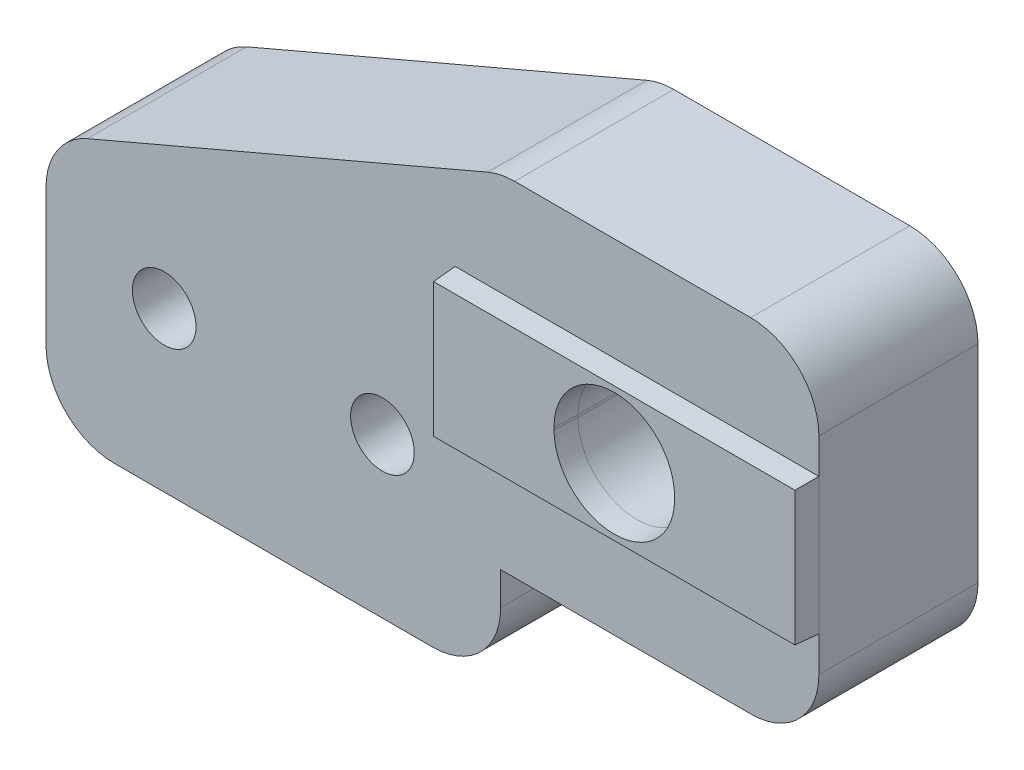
ISO-10303-21;
HEADER;
FILE_DESCRIPTION(('STEP AP214'),'2;1');
FILE_NAME('part.step','',(''),(''),'','','');
FILE_SCHEMA(('AUTOMOTIVE_DESIGN { 1 0 10303 214 1 1 1 1 }'));
ENDSEC;
DATA;
#1=APPLICATION_CONTEXT('core data for automotive mechanical design processes');
#2=APPLICATION_PROTOCOL_DEFINITION('international standard','automotive_design',2000,#1);
#3=PRODUCT_CONTEXT('',#1,'mechanical');
#4=PRODUCT('Part','Part','',(#3));
#5=PRODUCT_RELATED_PRODUCT_CATEGORY('part','',(#4));
#6=PRODUCT_DEFINITION_FORMATION('','',#4);
#7=PRODUCT_DEFINITION_CONTEXT('part definition',#1,'design');
#8=PRODUCT_DEFINITION('design','',#6,#7);
#9=PRODUCT_DEFINITION_SHAPE('','',#8);
#10=(LENGTH_UNIT() NAMED_UNIT(*) SI_UNIT(.MILLI.,.METRE.));
#11=(NAMED_UNIT(*) PLANE_ANGLE_UNIT() SI_UNIT($,.RADIAN.));
#12=(NAMED_UNIT(*) SI_UNIT($,.STERADIAN.) SOLID_ANGLE_UNIT());
#13=UNCERTAINTY_MEASURE_WITH_UNIT(LENGTH_MEASURE(1.E-05),#10,'distance_accuracy_value','');
#14=(GEOMETRIC_REPRESENTATION_CONTEXT(3) GLOBAL_UNCERTAINTY_ASSIGNED_CONTEXT((#13)) GLOBAL_UNIT_ASSIGNED_CONTEXT((#10,
#11,#12)) REPRESENTATION_CONTEXT('',''));
#15=CARTESIAN_POINT('',(0.,0.,0.));
#16=DIRECTION('',(0.,0.,1.));
#17=DIRECTION('',(1.,0.,0.));
#18=AXIS2_PLACEMENT_3D('',#15,#16,#17);
#19=CARTESIAN_POINT('',(31.,7.45,7.));
#20=DIRECTION('',(0.,0.,1.));
#21=DIRECTION('',(1.,0.,0.));
#22=AXIS2_PLACEMENT_3D('',#19,#20,#21);
#23=PLANE('',#22);
#24=CARTESIAN_POINT('',(14.8,7.,7.));
#25=DIRECTION('',(0.,0.,1.));
#26=DIRECTION('',(1.,0.,0.));
#27=AXIS2_PLACEMENT_3D('',#24,#25,#26);
#28=CIRCLE('',#27,1.4);
#29=CARTESIAN_POINT('',(16.2,7.,7.));
#30=VERTEX_POINT('',#29);
#31=EDGE_CURVE('E464',#30,#30,#28,.T.);
#32=ORIENTED_EDGE('',*,*,#31,.F.);
#33=EDGE_LOOP('',(#32));
#34=FACE_BOUND('',#33,.T.);
#35=CARTESIAN_POINT('',(5.2,7.,7.));
#36=DIRECTION('',(0.,0.,1.));
#37=DIRECTION('',(1.,0.,0.));
#38=AXIS2_PLACEMENT_3D('',#35,#36,#37);
#39=CIRCLE('',#38,1.4);
#40=CARTESIAN_POINT('',(6.6,7.,7.));
#41=VERTEX_POINT('',#40);
#42=EDGE_CURVE('E470',#41,#41,#39,.T.);
#43=ORIENTED_EDGE('',*,*,#42,.F.);
#44=EDGE_LOOP('',(#43));
#45=FACE_BOUND('',#44,.T.);
#46=DIRECTION('',(0.,-1.,0.));
#47=VECTOR('',#46,1.);
#48=CARTESIAN_POINT('',(18.,0.,7.));
#49=LINE('',#48,#47);
#50=CARTESIAN_POINT('',(18.,15.,7.));
#51=VERTEX_POINT('',#50);
#52=CARTESIAN_POINT('',(18.,9.,7.));
#53=VERTEX_POINT('',#52);
#54=EDGE_CURVE('E52',#51,#53,#49,.T.);
#55=ORIENTED_EDGE('',*,*,#54,.F.);
#56=DIRECTION('',(1.,0.,0.));
#57=VECTOR('',#56,1.);
#58=CARTESIAN_POINT('',(0.,15.,7.));
#59=LINE('',#58,#57);
#60=CARTESIAN_POINT('',(34.,15.,7.));
#61=VERTEX_POINT('',#60);
#62=EDGE_CURVE('E57',#51,#61,#59,.T.);
#63=ORIENTED_EDGE('',*,*,#62,.T.);
#64=DIRECTION('',(0.,1.,0.));
#65=VECTOR('',#64,1.);
#66=CARTESIAN_POINT('',(34.,7.45,7.));
#67=LINE('',#66,#65);
#68=CARTESIAN_POINT('',(34.,16.55,7.));
#69=VERTEX_POINT('',#68);
#70=EDGE_CURVE('E263',#61,#69,#67,.T.);
#71=ORIENTED_EDGE('',*,*,#70,.T.);
#72=CARTESIAN_POINT('',(31.,16.55,7.));
#73=DIRECTION('',(0.,0.,1.));
#74=DIRECTION('',(1.,0.,0.));
#75=AXIS2_PLACEMENT_3D('',#72,#73,#74);
#76=CIRCLE('',#75,3.);
#77=CARTESIAN_POINT('',(31.,19.55,7.));
#78=VERTEX_POINT('',#77);
#79=EDGE_CURVE('E268',#69,#78,#76,.T.);
#80=ORIENTED_EDGE('',*,*,#79,.T.);
#81=DIRECTION('',(-1.,0.,0.));
#82=VECTOR('',#81,1.);
#83=CARTESIAN_POINT('',(20.6143577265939,19.55,7.));
#84=LINE('',#83,#82);
#85=CARTESIAN_POINT('',(20.6143577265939,19.55,7.));
#86=VERTEX_POINT('',#85);
#87=EDGE_CURVE('E270',#78,#86,#84,.T.);
#88=ORIENTED_EDGE('',*,*,#87,.T.);
#89=CARTESIAN_POINT('',(20.6143577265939,16.55,7.));
#90=DIRECTION('',(0.,0.,1.));
#91=DIRECTION('',(1.,0.,0.));
#92=AXIS2_PLACEMENT_3D('',#89,#90,#91);
#93=CIRCLE('',#92,3.);
#94=CARTESIAN_POINT('',(19.4350972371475,19.3085040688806,7.));
#95=VERTEX_POINT('',#94);
#96=EDGE_CURVE('E272',#86,#95,#93,.T.);
#97=ORIENTED_EDGE('',*,*,#96,.T.);
#98=DIRECTION('',(-0.919501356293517,-0.393086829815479,0.));
#99=VECTOR('',#98,1.);
#100=CARTESIAN_POINT('',(19.4350972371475,19.3085040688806,7.));
#101=LINE('',#100,#99);
#102=CARTESIAN_POINT('',(1.82073951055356,11.7783661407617,7.));
#103=VERTEX_POINT('',#102);
#104=EDGE_CURVE('E274',#95,#103,#101,.T.);
#105=ORIENTED_EDGE('',*,*,#104,.T.);
#106=CARTESIAN_POINT('',(3.,9.0198620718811,7.));
#107=DIRECTION('',(0.,0.,1.));
#108=DIRECTION('',(1.,0.,0.));
#109=AXIS2_PLACEMENT_3D('',#106,#107,#108);
#110=CIRCLE('',#109,3.);
#111=CARTESIAN_POINT('',(0.,9.0198620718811,7.));
#112=VERTEX_POINT('',#111);
#113=EDGE_CURVE('E276',#103,#112,#110,.T.);
#114=ORIENTED_EDGE('',*,*,#113,.T.);
#115=DIRECTION('',(0.,-1.,0.));
#116=VECTOR('',#115,1.);
#117=CARTESIAN_POINT('',(0.,9.0198620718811,7.));
#118=LINE('',#117,#116);
#119=CARTESIAN_POINT('',(0.,3.00000000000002,7.));
#120=VERTEX_POINT('',#119);
#121=EDGE_CURVE('E278',#112,#120,#118,.T.);
#122=ORIENTED_EDGE('',*,*,#121,.T.);
#123=CARTESIAN_POINT('',(3.,3.,7.));
#124=DIRECTION('',(0.,0.,1.));
#125=DIRECTION('',(1.,0.,0.));
#126=AXIS2_PLACEMENT_3D('',#123,#124,#125);
#127=CIRCLE('',#126,3.);
#128=CARTESIAN_POINT('',(3.00000000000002,0.,7.));
#129=VERTEX_POINT('',#128);
#130=EDGE_CURVE('E280',#120,#129,#127,.T.);
#131=ORIENTED_EDGE('',*,*,#130,.T.);
#132=DIRECTION('',(1.,0.,0.));
#133=VECTOR('',#132,1.);
#134=CARTESIAN_POINT('',(3.00000000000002,0.,7.));
#135=LINE('',#134,#133);
#136=CARTESIAN_POINT('',(17.,0.,7.));
#137=VERTEX_POINT('',#136);
#138=EDGE_CURVE('E282',#129,#137,#135,.T.);
#139=ORIENTED_EDGE('',*,*,#138,.T.);
#140=CARTESIAN_POINT('',(17.,3.,7.));
#141=DIRECTION('',(0.,0.,1.));
#142=DIRECTION('',(1.,0.,0.));
#143=AXIS2_PLACEMENT_3D('',#140,#141,#142);
#144=CIRCLE('',#143,3.);
#145=CARTESIAN_POINT('',(20.,3.00000000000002,7.));
#146=VERTEX_POINT('',#145);
#147=EDGE_CURVE('E284',#137,#146,#144,.T.);
#148=ORIENTED_EDGE('',*,*,#147,.T.);
#149=DIRECTION('',(0.,1.,0.));
#150=VECTOR('',#149,1.);
#151=CARTESIAN_POINT('',(20.,3.00000000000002,7.));
#152=LINE('',#151,#150);
#153=CARTESIAN_POINT('',(20.,4.45,7.));
#154=VERTEX_POINT('',#153);
#155=EDGE_CURVE('E286',#146,#154,#152,.T.);
#156=ORIENTED_EDGE('',*,*,#155,.T.);
#157=DIRECTION('',(1.,0.,0.));
#158=VECTOR('',#157,1.);
#159=CARTESIAN_POINT('',(20.,4.45,7.));
#160=LINE('',#159,#158);
#161=CARTESIAN_POINT('',(31.,4.45,7.));
#162=VERTEX_POINT('',#161);
#163=EDGE_CURVE('E288',#154,#162,#160,.T.);
#164=ORIENTED_EDGE('',*,*,#163,.T.);
#165=CARTESIAN_POINT('',(31.,7.45,7.));
#166=DIRECTION('',(0.,0.,1.));
#167=DIRECTION('',(1.,0.,0.));
#168=AXIS2_PLACEMENT_3D('',#165,#166,#167);
#169=CIRCLE('',#168,3.);
#170=CARTESIAN_POINT('',(34.,7.45,7.));
#171=VERTEX_POINT('',#170);
#172=EDGE_CURVE('E260',#162,#171,#169,.T.);
#173=ORIENTED_EDGE('',*,*,#172,.T.);
#174=CARTESIAN_POINT('',(34.,9.,7.));
#175=VERTEX_POINT('',#174);
#176=EDGE_CURVE('E265',#171,#175,#67,.T.);
#177=ORIENTED_EDGE('',*,*,#176,.T.);
#178=DIRECTION('',(1.,0.,0.));
#179=VECTOR('',#178,1.);
#180=CARTESIAN_POINT('',(0.,9.,7.));
#181=LINE('',#180,#179);
#182=EDGE_CURVE('E394',#53,#175,#181,.T.);
#183=ORIENTED_EDGE('',*,*,#182,.F.);
#184=EDGE_LOOP('',(#55,#63,#71,#80,#88,#97,#105,#114,#122,#131,#139,#148,#156,#164,#173,#177,#183));
#185=FACE_BOUND('',#184,.T.);
#186=ADVANCED_FACE('F37',(#34,#45,#185),#23,.T.);
#187=CARTESIAN_POINT('',(26.,12.05,7.));
#188=DIRECTION('',(0.,0.,-1.));
#189=DIRECTION('',(-1.,0.,0.));
#190=AXIS2_PLACEMENT_3D('',#187,#188,#189);
#191=CYLINDRICAL_SURFACE('',#190,2.6);
#192=DIRECTION('',(0.,0.,-1.));
#193=VECTOR('',#192,1.);
#194=CARTESIAN_POINT('',(23.4,12.05,7.));
#195=LINE('',#194,#193);
#196=CARTESIAN_POINT('',(23.4,12.05,7.));
#197=VERTEX_POINT('',#196);
#198=CARTESIAN_POINT('',(23.4,12.05,2.5));
#199=VERTEX_POINT('',#198);
#200=EDGE_CURVE('E246',#197,#199,#195,.T.);
#201=ORIENTED_EDGE('',*,*,#200,.T.);
#202=CARTESIAN_POINT('',(26.,12.05,2.5));
#203=DIRECTION('',(0.,0.,-1.));
#204=DIRECTION('',(-1.,0.,0.));
#205=AXIS2_PLACEMENT_3D('',#202,#203,#204);
#206=CIRCLE('',#205,2.6);
#207=CARTESIAN_POINT('',(28.6,12.05,2.5));
#208=VERTEX_POINT('',#207);
#209=EDGE_CURVE('E460',#199,#208,#206,.T.);
#210=ORIENTED_EDGE('',*,*,#209,.T.);
#211=DIRECTION('',(0.,0.,-1.));
#212=VECTOR('',#211,1.);
#213=CARTESIAN_POINT('',(28.6,12.05,7.));
#214=LINE('',#213,#212);
#215=CARTESIAN_POINT('',(28.6,12.05,7.));
#216=VERTEX_POINT('',#215);
#217=EDGE_CURVE('E256',#216,#208,#214,.T.);
#218=ORIENTED_EDGE('',*,*,#217,.F.);
#219=CARTESIAN_POINT('',(26.,12.05,7.));
#220=DIRECTION('',(0.,0.,1.));
#221=DIRECTION('',(1.,0.,0.));
#222=AXIS2_PLACEMENT_3D('',#219,#220,#221);
#223=CIRCLE('',#222,2.6);
#224=EDGE_CURVE('E247',#216,#197,#223,.T.);
#225=ORIENTED_EDGE('',*,*,#224,.T.);
#226=EDGE_LOOP('',(#201,#210,#218,#225));
#227=FACE_BOUND('',#226,.T.);
#228=ADVANCED_FACE('F484',(#227),#191,.F.);
#229=CARTESIAN_POINT('',(23.4,12.05,7.));
#230=DIRECTION('',(1.,0.,0.));
#231=DIRECTION('',(0.,0.,-1.));
#232=AXIS2_PLACEMENT_3D('',#229,#230,#231);
#233=PLANE('',#232);
#234=DIRECTION('',(0.,0.,-1.));
#235=VECTOR('',#234,1.);
#236=CARTESIAN_POINT('',(23.4,11.95,7.));
#237=LINE('',#236,#235);
#238=CARTESIAN_POINT('',(23.4,11.95,7.));
#239=VERTEX_POINT('',#238);
#240=CARTESIAN_POINT('',(23.4,11.95,2.5));
#241=VERTEX_POINT('',#240);
#242=EDGE_CURVE('E244',#239,#241,#237,.T.);
#243=ORIENTED_EDGE('',*,*,#242,.T.);
#244=DIRECTION('',(0.,1.,0.));
#245=VECTOR('',#244,1.);
#246=CARTESIAN_POINT('',(23.4,12.05,2.5));
#247=LINE('',#246,#245);
#248=EDGE_CURVE('E458',#241,#199,#247,.T.);
#249=ORIENTED_EDGE('',*,*,#248,.T.);
#250=ORIENTED_EDGE('',*,*,#200,.F.);
#251=DIRECTION('',(0.,-1.,0.));
#252=VECTOR('',#251,1.);
#253=CARTESIAN_POINT('',(23.4,12.05,7.));
#254=LINE('',#253,#252);
#255=EDGE_CURVE('E219',#197,#239,#254,.T.);
#256=ORIENTED_EDGE('',*,*,#255,.T.);
#257=EDGE_LOOP('',(#243,#249,#250,#256));
#258=FACE_BOUND('',#257,.T.);
#259=ADVANCED_FACE('F242',(#258),#233,.T.);
#260=CARTESIAN_POINT('',(26.,11.95,7.));
#261=DIRECTION('',(0.,0.,-1.));
#262=DIRECTION('',(-1.,0.,0.));
#263=AXIS2_PLACEMENT_3D('',#260,#261,#262);
#264=CYLINDRICAL_SURFACE('',#263,2.6);
#265=DIRECTION('',(0.,0.,-1.));
#266=VECTOR('',#265,1.);
#267=CARTESIAN_POINT('',(28.6,11.95,7.));
#268=LINE('',#267,#266);
#269=CARTESIAN_POINT('',(28.6,11.95,7.));
#270=VERTEX_POINT('',#269);
#271=CARTESIAN_POINT('',(28.6,11.95,2.5));
#272=VERTEX_POINT('',#271);
#273=EDGE_CURVE('E252',#270,#272,#268,.T.);
#274=ORIENTED_EDGE('',*,*,#273,.T.);
#275=CARTESIAN_POINT('',(26.,11.95,2.5));
#276=DIRECTION('',(0.,0.,-1.));
#277=DIRECTION('',(-1.,0.,0.));
#278=AXIS2_PLACEMENT_3D('',#275,#276,#277);
#279=CIRCLE('',#278,2.6);
#280=EDGE_CURVE('E251',#272,#241,#279,.T.);
#281=ORIENTED_EDGE('',*,*,#280,.T.);
#282=ORIENTED_EDGE('',*,*,#242,.F.);
#283=CARTESIAN_POINT('',(26.,11.95,7.));
#284=DIRECTION('',(0.,0.,1.));
#285=DIRECTION('',(1.,0.,0.));
#286=AXIS2_PLACEMENT_3D('',#283,#284,#285);
#287=CIRCLE('',#286,2.6);
#288=EDGE_CURVE('E229',#239,#270,#287,.T.);
#289=ORIENTED_EDGE('',*,*,#288,.T.);
#290=EDGE_LOOP('',(#274,#281,#282,#289));
#291=FACE_BOUND('',#290,.T.);
#292=ADVANCED_FACE('F250',(#291),#264,.F.);
#293=CARTESIAN_POINT('',(28.6,12.05,7.));
#294=DIRECTION('',(-1.,0.,0.));
#295=DIRECTION('',(0.,0.,1.));
#296=AXIS2_PLACEMENT_3D('',#293,#294,#295);
#297=PLANE('',#296);
#298=ORIENTED_EDGE('',*,*,#217,.T.);
#299=DIRECTION('',(0.,-1.,0.));
#300=VECTOR('',#299,1.);
#301=CARTESIAN_POINT('',(28.6,12.05,2.5));
#302=LINE('',#301,#300);
#303=EDGE_CURVE('E11',#208,#272,#302,.T.);
#304=ORIENTED_EDGE('',*,*,#303,.T.);
#305=ORIENTED_EDGE('',*,*,#273,.F.);
#306=DIRECTION('',(0.,1.,0.));
#307=VECTOR('',#306,1.);
#308=CARTESIAN_POINT('',(28.6,12.05,7.));
#309=LINE('',#308,#307);
#310=EDGE_CURVE('E237',#270,#216,#309,.T.);
#311=ORIENTED_EDGE('',*,*,#310,.T.);
#312=EDGE_LOOP('',(#298,#304,#305,#311));
#313=FACE_BOUND('',#312,.T.);
#314=ADVANCED_FACE('F481',(#313),#297,.T.);
#315=CARTESIAN_POINT('',(31.,7.45,0.));
#316=DIRECTION('',(0.,0.,1.));
#317=DIRECTION('',(1.,0.,0.));
#318=AXIS2_PLACEMENT_3D('',#315,#316,#317);
#319=PLANE('',#318);
#320=DIRECTION('',(0.,-1.,0.));
#321=VECTOR('',#320,1.);
#322=CARTESIAN_POINT('',(30.75,12.05,0.));
#323=LINE('',#322,#321);
#324=CARTESIAN_POINT('',(30.75,12.05,0.));
#325=VERTEX_POINT('',#324);
#326=CARTESIAN_POINT('',(30.75,11.95,0.));
#327=VERTEX_POINT('',#326);
#328=EDGE_CURVE('E441',#325,#327,#323,.T.);
#329=ORIENTED_EDGE('',*,*,#328,.F.);
#330=CARTESIAN_POINT('',(26.,12.05,0.));
#331=DIRECTION('',(0.,0.,-1.));
#332=DIRECTION('',(-1.,0.,0.));
#333=AXIS2_PLACEMENT_3D('',#330,#331,#332);
#334=CIRCLE('',#333,4.75);
#335=CARTESIAN_POINT('',(21.25,12.05,0.));
#336=VERTEX_POINT('',#335);
#337=EDGE_CURVE('E412',#336,#325,#334,.T.);
#338=ORIENTED_EDGE('',*,*,#337,.F.);
#339=DIRECTION('',(0.,1.,0.));
#340=VECTOR('',#339,1.);
#341=CARTESIAN_POINT('',(21.25,12.05,0.));
#342=LINE('',#341,#340);
#343=CARTESIAN_POINT('',(21.25,11.95,0.));
#344=VERTEX_POINT('',#343);
#345=EDGE_CURVE('E430',#344,#336,#342,.T.);
#346=ORIENTED_EDGE('',*,*,#345,.F.);
#347=CARTESIAN_POINT('',(26.,11.95,0.));
#348=DIRECTION('',(0.,0.,-1.));
#349=DIRECTION('',(-1.,0.,0.));
#350=AXIS2_PLACEMENT_3D('',#347,#348,#349);
#351=CIRCLE('',#350,4.75);
#352=EDGE_CURVE('E444',#327,#344,#351,.T.);
#353=ORIENTED_EDGE('',*,*,#352,.F.);
#354=EDGE_LOOP('',(#329,#338,#346,#353));
#355=FACE_BOUND('',#354,.T.);
#356=CARTESIAN_POINT('',(31.,7.45,0.));
#357=DIRECTION('',(0.,0.,1.));
#358=DIRECTION('',(1.,0.,0.));
#359=AXIS2_PLACEMENT_3D('',#356,#357,#358);
#360=CIRCLE('',#359,3.);
#361=CARTESIAN_POINT('',(31.,4.45,0.));
#362=VERTEX_POINT('',#361);
#363=CARTESIAN_POINT('',(34.,7.45,0.));
#364=VERTEX_POINT('',#363);
#365=EDGE_CURVE('E254',#362,#364,#360,.T.);
#366=ORIENTED_EDGE('',*,*,#365,.F.);
#367=DIRECTION('',(1.,0.,0.));
#368=VECTOR('',#367,1.);
#369=CARTESIAN_POINT('',(20.,4.45,0.));
#370=LINE('',#369,#368);
#371=CARTESIAN_POINT('',(20.,4.45,0.));
#372=VERTEX_POINT('',#371);
#373=EDGE_CURVE('E264',#372,#362,#370,.T.);
#374=ORIENTED_EDGE('',*,*,#373,.F.);
#375=DIRECTION('',(0.,1.,0.));
#376=VECTOR('',#375,1.);
#377=CARTESIAN_POINT('',(20.,3.00000000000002,0.));
#378=LINE('',#377,#376);
#379=CARTESIAN_POINT('',(20.,3.00000000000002,0.));
#380=VERTEX_POINT('',#379);
#381=EDGE_CURVE('E313',#380,#372,#378,.T.);
#382=ORIENTED_EDGE('',*,*,#381,.F.);
#383=CARTESIAN_POINT('',(17.,3.,0.));
#384=DIRECTION('',(0.,0.,1.));
#385=DIRECTION('',(1.,0.,0.));
#386=AXIS2_PLACEMENT_3D('',#383,#384,#385);
#387=CIRCLE('',#386,3.);
#388=CARTESIAN_POINT('',(17.,0.,0.));
#389=VERTEX_POINT('',#388);
#390=EDGE_CURVE('E311',#389,#380,#387,.T.);
#391=ORIENTED_EDGE('',*,*,#390,.F.);
#392=DIRECTION('',(1.,0.,0.));
#393=VECTOR('',#392,1.);
#394=CARTESIAN_POINT('',(3.00000000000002,0.,0.));
#395=LINE('',#394,#393);
#396=CARTESIAN_POINT('',(3.00000000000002,0.,0.));
#397=VERTEX_POINT('',#396);
#398=EDGE_CURVE('E309',#397,#389,#395,.T.);
#399=ORIENTED_EDGE('',*,*,#398,.F.);
#400=CARTESIAN_POINT('',(3.,3.,0.));
#401=DIRECTION('',(0.,0.,1.));
#402=DIRECTION('',(1.,0.,0.));
#403=AXIS2_PLACEMENT_3D('',#400,#401,#402);
#404=CIRCLE('',#403,3.);
#405=CARTESIAN_POINT('',(0.,3.00000000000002,0.));
#406=VERTEX_POINT('',#405);
#407=EDGE_CURVE('E307',#406,#397,#404,.T.);
#408=ORIENTED_EDGE('',*,*,#407,.F.);
#409=DIRECTION('',(0.,-1.,0.));
#410=VECTOR('',#409,1.);
#411=CARTESIAN_POINT('',(0.,9.0198620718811,0.));
#412=LINE('',#411,#410);
#413=CARTESIAN_POINT('',(0.,9.0198620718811,0.));
#414=VERTEX_POINT('',#413);
#415=EDGE_CURVE('E305',#414,#406,#412,.T.);
#416=ORIENTED_EDGE('',*,*,#415,.F.);
#417=CARTESIAN_POINT('',(3.,9.0198620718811,0.));
#418=DIRECTION('',(0.,0.,1.));
#419=DIRECTION('',(1.,0.,0.));
#420=AXIS2_PLACEMENT_3D('',#417,#418,#419);
#421=CIRCLE('',#420,3.);
#422=CARTESIAN_POINT('',(1.82073951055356,11.7783661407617,0.));
#423=VERTEX_POINT('',#422);
#424=EDGE_CURVE('E303',#423,#414,#421,.T.);
#425=ORIENTED_EDGE('',*,*,#424,.F.);
#426=DIRECTION('',(-0.919501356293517,-0.393086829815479,0.));
#427=VECTOR('',#426,1.);
#428=CARTESIAN_POINT('',(19.4350972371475,19.3085040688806,0.));
#429=LINE('',#428,#427);
#430=CARTESIAN_POINT('',(19.4350972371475,19.3085040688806,0.));
#431=VERTEX_POINT('',#430);
#432=EDGE_CURVE('E301',#431,#423,#429,.T.);
#433=ORIENTED_EDGE('',*,*,#432,.F.);
#434=CARTESIAN_POINT('',(20.6143577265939,16.55,0.));
#435=DIRECTION('',(0.,0.,1.));
#436=DIRECTION('',(1.,0.,0.));
#437=AXIS2_PLACEMENT_3D('',#434,#435,#436);
#438=CIRCLE('',#437,3.);
#439=CARTESIAN_POINT('',(20.6143577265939,19.55,0.));
#440=VERTEX_POINT('',#439);
#441=EDGE_CURVE('E299',#440,#431,#438,.T.);
#442=ORIENTED_EDGE('',*,*,#441,.F.);
#443=DIRECTION('',(-1.,0.,0.));
#444=VECTOR('',#443,1.);
#445=CARTESIAN_POINT('',(20.6143577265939,19.55,0.));
#446=LINE('',#445,#444);
#447=CARTESIAN_POINT('',(31.,19.55,0.));
#448=VERTEX_POINT('',#447);
#449=EDGE_CURVE('E297',#448,#440,#446,.T.);
#450=ORIENTED_EDGE('',*,*,#449,.F.);
#451=CARTESIAN_POINT('',(31.,16.55,0.));
#452=DIRECTION('',(0.,0.,1.));
#453=DIRECTION('',(1.,0.,0.));
#454=AXIS2_PLACEMENT_3D('',#451,#452,#453);
#455=CIRCLE('',#454,3.);
#456=CARTESIAN_POINT('',(34.,16.55,0.));
#457=VERTEX_POINT('',#456);
#458=EDGE_CURVE('E295',#457,#448,#455,.T.);
#459=ORIENTED_EDGE('',*,*,#458,.F.);
#460=DIRECTION('',(0.,1.,0.));
#461=VECTOR('',#460,1.);
#462=CARTESIAN_POINT('',(34.,7.45,0.));
#463=LINE('',#462,#461);
#464=EDGE_CURVE('E293',#364,#457,#463,.T.);
#465=ORIENTED_EDGE('',*,*,#464,.F.);
#466=EDGE_LOOP('',(#366,#374,#382,#391,#399,#408,#416,#425,#433,#442,#450,#459,#465));
#467=FACE_BOUND('',#466,.T.);
#468=CARTESIAN_POINT('',(5.2,7.,0.));
#469=DIRECTION('',(0.,0.,1.));
#470=DIRECTION('',(1.,0.,0.));
#471=AXIS2_PLACEMENT_3D('',#468,#469,#470);
#472=CIRCLE('',#471,1.4);
#473=CARTESIAN_POINT('',(6.6,7.,0.));
#474=VERTEX_POINT('',#473);
#475=EDGE_CURVE('E467',#474,#474,#472,.T.);
#476=ORIENTED_EDGE('',*,*,#475,.T.);
#477=EDGE_LOOP('',(#476));
#478=FACE_BOUND('',#477,.T.);
#479=CARTESIAN_POINT('',(14.8,7.,0.));
#480=DIRECTION('',(0.,0.,1.));
#481=DIRECTION('',(1.,0.,0.));
#482=AXIS2_PLACEMENT_3D('',#479,#480,#481);
#483=CIRCLE('',#482,1.4);
#484=CARTESIAN_POINT('',(16.2,7.,0.));
#485=VERTEX_POINT('',#484);
#486=EDGE_CURVE('E463',#485,#485,#483,.T.);
#487=ORIENTED_EDGE('',*,*,#486,.T.);
#488=EDGE_LOOP('',(#487));
#489=FACE_BOUND('',#488,.T.);
#490=ADVANCED_FACE('F361',(#355,#467,#478,#489),#319,.F.);
#491=CARTESIAN_POINT('',(31.,7.45,7.));
#492=DIRECTION('',(0.,0.,-1.));
#493=DIRECTION('',(-1.,0.,0.));
#494=AXIS2_PLACEMENT_3D('',#491,#492,#493);
#495=CYLINDRICAL_SURFACE('',#494,3.);
#496=ORIENTED_EDGE('',*,*,#365,.T.);
#497=DIRECTION('',(0.,0.,-1.));
#498=VECTOR('',#497,1.);
#499=CARTESIAN_POINT('',(34.,7.45,7.));
#500=LINE('',#499,#498);
#501=EDGE_CURVE('E45',#171,#364,#500,.T.);
#502=ORIENTED_EDGE('',*,*,#501,.F.);
#503=ORIENTED_EDGE('',*,*,#172,.F.);
#504=DIRECTION('',(0.,0.,-1.));
#505=VECTOR('',#504,1.);
#506=CARTESIAN_POINT('',(31.,4.45,7.));
#507=LINE('',#506,#505);
#508=EDGE_CURVE('E290',#162,#362,#507,.T.);
#509=ORIENTED_EDGE('',*,*,#508,.T.);
#510=EDGE_LOOP('',(#496,#502,#503,#509));
#511=FACE_BOUND('',#510,.T.);
#512=ADVANCED_FACE('F39',(#511),#495,.T.);
#513=CARTESIAN_POINT('',(34.,7.45,7.));
#514=DIRECTION('',(-1.,0.,0.));
#515=DIRECTION('',(0.,0.,1.));
#516=AXIS2_PLACEMENT_3D('',#513,#514,#515);
#517=PLANE('',#516);
#518=ORIENTED_EDGE('',*,*,#464,.T.);
#519=DIRECTION('',(0.,0.,-1.));
#520=VECTOR('',#519,1.);
#521=CARTESIAN_POINT('',(34.,16.55,7.));
#522=LINE('',#521,#520);
#523=EDGE_CURVE('E348',#69,#457,#522,.T.);
#524=ORIENTED_EDGE('',*,*,#523,.F.);
#525=ORIENTED_EDGE('',*,*,#70,.F.);
#526=DIRECTION('',(0.,1.,0.));
#527=VECTOR('',#526,1.);
#528=CARTESIAN_POINT('',(34.,0.,7.));
#529=LINE('',#528,#527);
#530=EDGE_CURVE('E379',#175,#61,#529,.T.);
#531=ORIENTED_EDGE('',*,*,#530,.F.);
#532=ORIENTED_EDGE('',*,*,#176,.F.);
#533=ORIENTED_EDGE('',*,*,#501,.T.);
#534=EDGE_LOOP('',(#518,#524,#525,#531,#532,#533));
#535=FACE_BOUND('',#534,.T.);
#536=ADVANCED_FACE('F353',(#535),#517,.F.);
#537=CARTESIAN_POINT('',(31.,16.55,7.));
#538=DIRECTION('',(0.,0.,-1.));
#539=DIRECTION('',(-1.,0.,0.));
#540=AXIS2_PLACEMENT_3D('',#537,#538,#539);
#541=CYLINDRICAL_SURFACE('',#540,3.);
#542=ORIENTED_EDGE('',*,*,#458,.T.);
#543=DIRECTION('',(0.,0.,-1.));
#544=VECTOR('',#543,1.);
#545=CARTESIAN_POINT('',(31.,19.55,7.));
#546=LINE('',#545,#544);
#547=EDGE_CURVE('E345',#78,#448,#546,.T.);
#548=ORIENTED_EDGE('',*,*,#547,.F.);
#549=ORIENTED_EDGE('',*,*,#79,.F.);
#550=ORIENTED_EDGE('',*,*,#523,.T.);
#551=EDGE_LOOP('',(#542,#548,#549,#550));
#552=FACE_BOUND('',#551,.T.);
#553=ADVANCED_FACE('F369',(#552),#541,.T.);
#554=CARTESIAN_POINT('',(20.6143577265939,19.55,7.));
#555=DIRECTION('',(0.,-1.,0.));
#556=DIRECTION('',(1.,0.,0.));
#557=AXIS2_PLACEMENT_3D('',#554,#555,#556);
#558=PLANE('',#557);
#559=ORIENTED_EDGE('',*,*,#449,.T.);
#560=DIRECTION('',(0.,0.,-1.));
#561=VECTOR('',#560,1.);
#562=CARTESIAN_POINT('',(20.6143577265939,19.55,7.));
#563=LINE('',#562,#561);
#564=EDGE_CURVE('E342',#86,#440,#563,.T.);
#565=ORIENTED_EDGE('',*,*,#564,.F.);
#566=ORIENTED_EDGE('',*,*,#87,.F.);
#567=ORIENTED_EDGE('',*,*,#547,.T.);
#568=EDGE_LOOP('',(#559,#565,#566,#567));
#569=FACE_BOUND('',#568,.T.);
#570=ADVANCED_FACE('F373',(#569),#558,.F.);
#571=CARTESIAN_POINT('',(20.6143577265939,16.55,7.));
#572=DIRECTION('',(0.,0.,-1.));
#573=DIRECTION('',(-1.,0.,0.));
#574=AXIS2_PLACEMENT_3D('',#571,#572,#573);
#575=CYLINDRICAL_SURFACE('',#574,3.);
#576=ORIENTED_EDGE('',*,*,#441,.T.);
#577=DIRECTION('',(0.,0.,-1.));
#578=VECTOR('',#577,1.);
#579=CARTESIAN_POINT('',(19.4350972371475,19.3085040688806,7.));
#580=LINE('',#579,#578);
#581=EDGE_CURVE('E339',#95,#431,#580,.T.);
#582=ORIENTED_EDGE('',*,*,#581,.F.);
#583=ORIENTED_EDGE('',*,*,#96,.F.);
#584=ORIENTED_EDGE('',*,*,#564,.T.);
#585=EDGE_LOOP('',(#576,#582,#583,#584));
#586=FACE_BOUND('',#585,.T.);
#587=ADVANCED_FACE('F615',(#586),#575,.T.);
#588=CARTESIAN_POINT('',(19.4350972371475,19.3085040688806,7.));
#589=DIRECTION('',(0.393086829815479,-0.919501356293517,0.));
#590=DIRECTION('',(0.919501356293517,0.393086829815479,0.));
#591=AXIS2_PLACEMENT_3D('',#588,#589,#590);
#592=PLANE('',#591);
#593=ORIENTED_EDGE('',*,*,#432,.T.);
#594=DIRECTION('',(0.,0.,-1.));
#595=VECTOR('',#594,1.);
#596=CARTESIAN_POINT('',(1.82073951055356,11.7783661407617,7.));
#597=LINE('',#596,#595);
#598=EDGE_CURVE('E336',#103,#423,#597,.T.);
#599=ORIENTED_EDGE('',*,*,#598,.F.);
#600=ORIENTED_EDGE('',*,*,#104,.F.);
#601=ORIENTED_EDGE('',*,*,#581,.T.);
#602=EDGE_LOOP('',(#593,#599,#600,#601));
#603=FACE_BOUND('',#602,.T.);
#604=ADVANCED_FACE('F613',(#603),#592,.F.);
#605=CARTESIAN_POINT('',(3.,9.0198620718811,7.));
#606=DIRECTION('',(0.,0.,-1.));
#607=DIRECTION('',(-1.,0.,0.));
#608=AXIS2_PLACEMENT_3D('',#605,#606,#607);
#609=CYLINDRICAL_SURFACE('',#608,3.);
#610=ORIENTED_EDGE('',*,*,#424,.T.);
#611=DIRECTION('',(0.,0.,-1.));
#612=VECTOR('',#611,1.);
#613=CARTESIAN_POINT('',(0.,9.0198620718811,7.));
#614=LINE('',#613,#612);
#615=EDGE_CURVE('E333',#112,#414,#614,.T.);
#616=ORIENTED_EDGE('',*,*,#615,.F.);
#617=ORIENTED_EDGE('',*,*,#113,.F.);
#618=ORIENTED_EDGE('',*,*,#598,.T.);
#619=EDGE_LOOP('',(#610,#616,#617,#618));
#620=FACE_BOUND('',#619,.T.);
#621=ADVANCED_FACE('F609',(#620),#609,.T.);
#622=CARTESIAN_POINT('',(0.,9.0198620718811,7.));
#623=DIRECTION('',(1.,0.,0.));
#624=DIRECTION('',(0.,1.,0.));
#625=AXIS2_PLACEMENT_3D('',#622,#623,#624);
#626=PLANE('',#625);
#627=ORIENTED_EDGE('',*,*,#415,.T.);
#628=DIRECTION('',(0.,0.,-1.));
#629=VECTOR('',#628,1.);
#630=CARTESIAN_POINT('',(0.,3.00000000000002,7.));
#631=LINE('',#630,#629);
#632=EDGE_CURVE('E330',#120,#406,#631,.T.);
#633=ORIENTED_EDGE('',*,*,#632,.F.);
#634=ORIENTED_EDGE('',*,*,#121,.F.);
#635=ORIENTED_EDGE('',*,*,#615,.T.);
#636=EDGE_LOOP('',(#627,#633,#634,#635));
#637=FACE_BOUND('',#636,.T.);
#638=ADVANCED_FACE('F604',(#637),#626,.F.);
#639=CARTESIAN_POINT('',(3.,3.,7.));
#640=DIRECTION('',(0.,0.,-1.));
#641=DIRECTION('',(-1.,0.,0.));
#642=AXIS2_PLACEMENT_3D('',#639,#640,#641);
#643=CYLINDRICAL_SURFACE('',#642,3.);
#644=ORIENTED_EDGE('',*,*,#407,.T.);
#645=DIRECTION('',(0.,0.,-1.));
#646=VECTOR('',#645,1.);
#647=CARTESIAN_POINT('',(3.00000000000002,0.,7.));
#648=LINE('',#647,#646);
#649=EDGE_CURVE('E327',#129,#397,#648,.T.);
#650=ORIENTED_EDGE('',*,*,#649,.F.);
#651=ORIENTED_EDGE('',*,*,#130,.F.);
#652=ORIENTED_EDGE('',*,*,#632,.T.);
#653=EDGE_LOOP('',(#644,#650,#651,#652));
#654=FACE_BOUND('',#653,.T.);
#655=ADVANCED_FACE('F598',(#654),#643,.T.);
#656=CARTESIAN_POINT('',(3.00000000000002,0.,7.));
#657=DIRECTION('',(0.,1.,0.));
#658=DIRECTION('',(0.,0.,1.));
#659=AXIS2_PLACEMENT_3D('',#656,#657,#658);
#660=PLANE('',#659);
#661=ORIENTED_EDGE('',*,*,#398,.T.);
#662=DIRECTION('',(0.,0.,-1.));
#663=VECTOR('',#662,1.);
#664=CARTESIAN_POINT('',(17.,0.,7.));
#665=LINE('',#664,#663);
#666=EDGE_CURVE('E324',#137,#389,#665,.T.);
#667=ORIENTED_EDGE('',*,*,#666,.F.);
#668=ORIENTED_EDGE('',*,*,#138,.F.);
#669=ORIENTED_EDGE('',*,*,#649,.T.);
#670=EDGE_LOOP('',(#661,#667,#668,#669));
#671=FACE_BOUND('',#670,.T.);
#672=ADVANCED_FACE('F594',(#671),#660,.F.);
#673=CARTESIAN_POINT('',(17.,3.,7.));
#674=DIRECTION('',(0.,0.,-1.));
#675=DIRECTION('',(-1.,0.,0.));
#676=AXIS2_PLACEMENT_3D('',#673,#674,#675);
#677=CYLINDRICAL_SURFACE('',#676,3.);
#678=ORIENTED_EDGE('',*,*,#390,.T.);
#679=DIRECTION('',(0.,0.,-1.));
#680=VECTOR('',#679,1.);
#681=CARTESIAN_POINT('',(20.,3.00000000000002,7.));
#682=LINE('',#681,#680);
#683=EDGE_CURVE('E321',#146,#380,#682,.T.);
#684=ORIENTED_EDGE('',*,*,#683,.F.);
#685=ORIENTED_EDGE('',*,*,#147,.F.);
#686=ORIENTED_EDGE('',*,*,#666,.T.);
#687=EDGE_LOOP('',(#678,#684,#685,#686));
#688=FACE_BOUND('',#687,.T.);
#689=ADVANCED_FACE('F589',(#688),#677,.T.);
#690=CARTESIAN_POINT('',(20.,3.00000000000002,7.));
#691=DIRECTION('',(-1.,0.,0.));
#692=DIRECTION('',(0.,0.,1.));
#693=AXIS2_PLACEMENT_3D('',#690,#691,#692);
#694=PLANE('',#693);
#695=ORIENTED_EDGE('',*,*,#381,.T.);
#696=DIRECTION('',(0.,0.,-1.));
#697=VECTOR('',#696,1.);
#698=CARTESIAN_POINT('',(20.,4.45,7.));
#699=LINE('',#698,#697);
#700=EDGE_CURVE('E318',#154,#372,#699,.T.);
#701=ORIENTED_EDGE('',*,*,#700,.F.);
#702=ORIENTED_EDGE('',*,*,#155,.F.);
#703=ORIENTED_EDGE('',*,*,#683,.T.);
#704=EDGE_LOOP('',(#695,#701,#702,#703));
#705=FACE_BOUND('',#704,.T.);
#706=ADVANCED_FACE('F583',(#705),#694,.F.);
#707=CARTESIAN_POINT('',(20.,4.45,7.));
#708=DIRECTION('',(0.,1.,0.));
#709=DIRECTION('',(-1.,0.,0.));
#710=AXIS2_PLACEMENT_3D('',#707,#708,#709);
#711=PLANE('',#710);
#712=ORIENTED_EDGE('',*,*,#373,.T.);
#713=ORIENTED_EDGE('',*,*,#508,.F.);
#714=ORIENTED_EDGE('',*,*,#163,.F.);
#715=ORIENTED_EDGE('',*,*,#700,.T.);
#716=EDGE_LOOP('',(#712,#713,#714,#715));
#717=FACE_BOUND('',#716,.T.);
#718=ADVANCED_FACE('F533',(#717),#711,.F.);
#719=CARTESIAN_POINT('',(5.2,7.,7.));
#720=DIRECTION('',(0.,0.,-1.));
#721=DIRECTION('',(-1.,0.,0.));
#722=AXIS2_PLACEMENT_3D('',#719,#720,#721);
#723=CYLINDRICAL_SURFACE('',#722,1.4);
#724=ORIENTED_EDGE('',*,*,#42,.T.);
#725=EDGE_LOOP('',(#724));
#726=FACE_BOUND('',#725,.T.);
#727=ORIENTED_EDGE('',*,*,#475,.F.);
#728=EDGE_LOOP('',(#727));
#729=FACE_BOUND('',#728,.T.);
#730=ADVANCED_FACE('F529',(#726,#729),#723,.F.);
#731=CARTESIAN_POINT('',(14.8,7.,7.));
#732=DIRECTION('',(0.,0.,-1.));
#733=DIRECTION('',(-1.,0.,0.));
#734=AXIS2_PLACEMENT_3D('',#731,#732,#733);
#735=CYLINDRICAL_SURFACE('',#734,1.4);
#736=ORIENTED_EDGE('',*,*,#31,.T.);
#737=EDGE_LOOP('',(#736));
#738=FACE_BOUND('',#737,.T.);
#739=ORIENTED_EDGE('',*,*,#486,.F.);
#740=EDGE_LOOP('',(#739));
#741=FACE_BOUND('',#740,.T.);
#742=ADVANCED_FACE('F532',(#738,#741),#735,.F.);
#743=CARTESIAN_POINT('',(26.,12.05,2.5));
#744=DIRECTION('',(0.,0.,-1.));
#745=DIRECTION('',(-1.,0.,0.));
#746=AXIS2_PLACEMENT_3D('',#743,#744,#745);
#747=CYLINDRICAL_SURFACE('',#746,4.75);
#748=ORIENTED_EDGE('',*,*,#337,.T.);
#749=DIRECTION('',(0.,0.,-1.));
#750=VECTOR('',#749,1.);
#751=CARTESIAN_POINT('',(30.75,12.05,2.5));
#752=LINE('',#751,#750);
#753=CARTESIAN_POINT('',(30.75,12.05,2.5));
#754=VERTEX_POINT('',#753);
#755=EDGE_CURVE('E439',#754,#325,#752,.T.);
#756=ORIENTED_EDGE('',*,*,#755,.F.);
#757=CARTESIAN_POINT('',(26.,12.05,2.5));
#758=DIRECTION('',(0.,0.,-1.));
#759=DIRECTION('',(-1.,0.,0.));
#760=AXIS2_PLACEMENT_3D('',#757,#758,#759);
#761=CIRCLE('',#760,4.75);
#762=CARTESIAN_POINT('',(21.25,12.05,2.5));
#763=VERTEX_POINT('',#762);
#764=EDGE_CURVE('E426',#763,#754,#761,.T.);
#765=ORIENTED_EDGE('',*,*,#764,.F.);
#766=DIRECTION('',(0.,0.,-1.));
#767=VECTOR('',#766,1.);
#768=CARTESIAN_POINT('',(21.25,12.05,2.5));
#769=LINE('',#768,#767);
#770=EDGE_CURVE('E449',#763,#336,#769,.T.);
#771=ORIENTED_EDGE('',*,*,#770,.T.);
#772=EDGE_LOOP('',(#748,#756,#765,#771));
#773=FACE_BOUND('',#772,.T.);
#774=ADVANCED_FACE('F495',(#773),#747,.F.);
#775=CARTESIAN_POINT('',(21.25,12.05,2.5));
#776=DIRECTION('',(-1.,0.,0.));
#777=DIRECTION('',(0.,0.,1.));
#778=AXIS2_PLACEMENT_3D('',#775,#776,#777);
#779=PLANE('',#778);
#780=ORIENTED_EDGE('',*,*,#345,.T.);
#781=ORIENTED_EDGE('',*,*,#770,.F.);
#782=DIRECTION('',(0.,1.,0.));
#783=VECTOR('',#782,1.);
#784=CARTESIAN_POINT('',(21.25,12.05,2.5));
#785=LINE('',#784,#783);
#786=CARTESIAN_POINT('',(21.25,11.95,2.5));
#787=VERTEX_POINT('',#786);
#788=EDGE_CURVE('E436',#787,#763,#785,.T.);
#789=ORIENTED_EDGE('',*,*,#788,.F.);
#790=DIRECTION('',(0.,0.,-1.));
#791=VECTOR('',#790,1.);
#792=CARTESIAN_POINT('',(21.25,11.95,2.5));
#793=LINE('',#792,#791);
#794=EDGE_CURVE('E451',#787,#344,#793,.T.);
#795=ORIENTED_EDGE('',*,*,#794,.T.);
#796=EDGE_LOOP('',(#780,#781,#789,#795));
#797=FACE_BOUND('',#796,.T.);
#798=ADVANCED_FACE('F504',(#797),#779,.F.);
#799=CARTESIAN_POINT('',(26.,11.95,2.5));
#800=DIRECTION('',(0.,0.,-1.));
#801=DIRECTION('',(-1.,0.,0.));
#802=AXIS2_PLACEMENT_3D('',#799,#800,#801);
#803=CYLINDRICAL_SURFACE('',#802,4.75);
#804=ORIENTED_EDGE('',*,*,#352,.T.);
#805=ORIENTED_EDGE('',*,*,#794,.F.);
#806=CARTESIAN_POINT('',(26.,11.95,2.5));
#807=DIRECTION('',(0.,0.,-1.));
#808=DIRECTION('',(-1.,0.,0.));
#809=AXIS2_PLACEMENT_3D('',#806,#807,#808);
#810=CIRCLE('',#809,4.75);
#811=CARTESIAN_POINT('',(30.75,11.95,2.5));
#812=VERTEX_POINT('',#811);
#813=EDGE_CURVE('E433',#812,#787,#810,.T.);
#814=ORIENTED_EDGE('',*,*,#813,.F.);
#815=DIRECTION('',(0.,0.,-1.));
#816=VECTOR('',#815,1.);
#817=CARTESIAN_POINT('',(30.75,11.95,2.5));
#818=LINE('',#817,#816);
#819=EDGE_CURVE('E453',#812,#327,#818,.T.);
#820=ORIENTED_EDGE('',*,*,#819,.T.);
#821=EDGE_LOOP('',(#804,#805,#814,#820));
#822=FACE_BOUND('',#821,.T.);
#823=ADVANCED_FACE('F502',(#822),#803,.F.);
#824=CARTESIAN_POINT('',(30.75,12.05,2.5));
#825=DIRECTION('',(1.,0.,0.));
#826=DIRECTION('',(0.,0.,-1.));
#827=AXIS2_PLACEMENT_3D('',#824,#825,#826);
#828=PLANE('',#827);
#829=ORIENTED_EDGE('',*,*,#328,.T.);
#830=ORIENTED_EDGE('',*,*,#819,.F.);
#831=DIRECTION('',(0.,-1.,0.));
#832=VECTOR('',#831,1.);
#833=CARTESIAN_POINT('',(30.75,12.05,2.5));
#834=LINE('',#833,#832);
#835=EDGE_CURVE('E429',#754,#812,#834,.T.);
#836=ORIENTED_EDGE('',*,*,#835,.F.);
#837=ORIENTED_EDGE('',*,*,#755,.T.);
#838=EDGE_LOOP('',(#829,#830,#836,#837));
#839=FACE_BOUND('',#838,.T.);
#840=ADVANCED_FACE('F489',(#839),#828,.F.);
#841=CARTESIAN_POINT('',(26.,12.05,2.5));
#842=DIRECTION('',(0.,0.,-1.));
#843=DIRECTION('',(-1.,0.,0.));
#844=AXIS2_PLACEMENT_3D('',#841,#842,#843);
#845=PLANE('',#844);
#846=ORIENTED_EDGE('',*,*,#248,.F.);
#847=ORIENTED_EDGE('',*,*,#280,.F.);
#848=ORIENTED_EDGE('',*,*,#303,.F.);
#849=ORIENTED_EDGE('',*,*,#209,.F.);
#850=EDGE_LOOP('',(#846,#847,#848,#849));
#851=FACE_BOUND('',#850,.T.);
#852=ORIENTED_EDGE('',*,*,#764,.T.);
#853=ORIENTED_EDGE('',*,*,#835,.T.);
#854=ORIENTED_EDGE('',*,*,#813,.T.);
#855=ORIENTED_EDGE('',*,*,#788,.T.);
#856=EDGE_LOOP('',(#852,#853,#854,#855));
#857=FACE_BOUND('',#856,.T.);
#858=ADVANCED_FACE('F486',(#851,#857),#845,.T.);
#859=CARTESIAN_POINT('',(0.,15.,7.));
#860=DIRECTION('',(0.,0.998629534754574,0.0523359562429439));
#861=DIRECTION('',(0.,-0.052335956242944,0.998629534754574));
#862=AXIS2_PLACEMENT_3D('',#859,#860,#861);
#863=PLANE('',#862);
#864=ORIENTED_EDGE('',*,*,#62,.F.);
#865=DIRECTION('',(0.052264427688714,-0.052264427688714,0.997264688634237));
#866=VECTOR('',#865,1.);
#867=CARTESIAN_POINT('',(17.9508317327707,15.0491682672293,6.06181357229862));
#868=LINE('',#867,#866);
#869=CARTESIAN_POINT('',(18.052407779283,14.947592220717,8.));
#870=VERTEX_POINT('',#869);
#871=EDGE_CURVE('E411',#870,#51,#868,.F.);
#872=ORIENTED_EDGE('',*,*,#871,.F.);
#873=DIRECTION('',(1.,0.,0.));
#874=VECTOR('',#873,1.);
#875=CARTESIAN_POINT('',(0.,14.947592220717,8.));
#876=LINE('',#875,#874);
#877=CARTESIAN_POINT('',(33.947592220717,14.947592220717,8.));
#878=VERTEX_POINT('',#877);
#879=EDGE_CURVE('E385',#870,#878,#876,.T.);
#880=ORIENTED_EDGE('',*,*,#879,.T.);
#881=DIRECTION('',(-0.052264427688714,-0.052264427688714,0.997264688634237));
#882=VECTOR('',#881,1.);
#883=CARTESIAN_POINT('',(33.9590264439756,14.9590264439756,7.78182202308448));
#884=LINE('',#883,#882);
#885=EDGE_CURVE('E225',#878,#61,#884,.F.);
#886=ORIENTED_EDGE('',*,*,#885,.T.);
#887=EDGE_LOOP('',(#864,#872,#880,#886));
#888=FACE_BOUND('',#887,.T.);
#889=ADVANCED_FACE('F383',(#888),#863,.T.);
#890=CARTESIAN_POINT('',(18.,0.,7.));
#891=DIRECTION('',(-0.998629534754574,0.,0.0523359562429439));
#892=DIRECTION('',(0.052335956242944,0.,0.998629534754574));
#893=AXIS2_PLACEMENT_3D('',#890,#891,#892);
#894=PLANE('',#893);
#895=ORIENTED_EDGE('',*,*,#54,.T.);
#896=DIRECTION('',(-0.052264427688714,-0.052264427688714,-0.997264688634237));
#897=VECTOR('',#896,1.);
#898=CARTESIAN_POINT('',(17.9508317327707,8.95083173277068,6.06181357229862));
#899=LINE('',#898,#897);
#900=CARTESIAN_POINT('',(18.052407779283,9.05240777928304,8.));
#901=VERTEX_POINT('',#900);
#902=EDGE_CURVE('E413',#901,#53,#899,.T.);
#903=ORIENTED_EDGE('',*,*,#902,.F.);
#904=DIRECTION('',(0.,1.,0.));
#905=VECTOR('',#904,1.);
#906=CARTESIAN_POINT('',(18.052407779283,0.,8.));
#907=LINE('',#906,#905);
#908=EDGE_CURVE('E419',#870,#901,#907,.F.);
#909=ORIENTED_EDGE('',*,*,#908,.F.);
#910=ORIENTED_EDGE('',*,*,#871,.T.);
#911=EDGE_LOOP('',(#895,#903,#909,#910));
#912=FACE_BOUND('',#911,.T.);
#913=ADVANCED_FACE('F546',(#912),#894,.T.);
#914=CARTESIAN_POINT('',(0.,9.,7.));
#915=DIRECTION('',(0.,-0.998629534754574,0.0523359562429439));
#916=DIRECTION('',(0.,-0.052335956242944,-0.998629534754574));
#917=AXIS2_PLACEMENT_3D('',#914,#915,#916);
#918=PLANE('',#917);
#919=ORIENTED_EDGE('',*,*,#182,.T.);
#920=DIRECTION('',(0.052264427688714,-0.052264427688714,-0.997264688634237));
#921=VECTOR('',#920,1.);
#922=CARTESIAN_POINT('',(34.0245841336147,8.97541586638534,6.53090678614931));
#923=LINE('',#922,#921);
#924=CARTESIAN_POINT('',(33.947592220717,9.05240777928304,8.));
#925=VERTEX_POINT('',#924);
#926=EDGE_CURVE('E387',#925,#175,#923,.T.);
#927=ORIENTED_EDGE('',*,*,#926,.F.);
#928=DIRECTION('',(-1.,0.,0.));
#929=VECTOR('',#928,1.);
#930=CARTESIAN_POINT('',(0.,9.05240777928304,8.));
#931=LINE('',#930,#929);
#932=EDGE_CURVE('E422',#901,#925,#931,.F.);
#933=ORIENTED_EDGE('',*,*,#932,.F.);
#934=ORIENTED_EDGE('',*,*,#902,.T.);
#935=EDGE_LOOP('',(#919,#927,#933,#934));
#936=FACE_BOUND('',#935,.T.);
#937=ADVANCED_FACE('F549',(#936),#918,.T.);
#938=CARTESIAN_POINT('',(26.,11.95,7.));
#939=DIRECTION('',(0.,0.,1.));
#940=DIRECTION('',(1.,0.,0.));
#941=AXIS2_PLACEMENT_3D('',#938,#939,#940);
#942=CONICAL_SURFACE('',#941,2.6,0.05235987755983);
#943=ORIENTED_EDGE('',*,*,#288,.F.);
#944=DIRECTION('',(0.0523359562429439,0.,-0.998629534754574));
#945=VECTOR('',#944,1.);
#946=CARTESIAN_POINT('',(23.4,11.95,7.));
#947=LINE('',#946,#945);
#948=CARTESIAN_POINT('',(23.347592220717,11.95,8.));
#949=VERTEX_POINT('',#948);
#950=EDGE_CURVE('E214',#949,#239,#947,.T.);
#951=ORIENTED_EDGE('',*,*,#950,.F.);
#952=CARTESIAN_POINT('',(26.,11.95,8.));
#953=DIRECTION('',(0.,0.,1.));
#954=DIRECTION('',(1.,0.,0.));
#955=AXIS2_PLACEMENT_3D('',#952,#953,#954);
#956=CIRCLE('',#955,2.65240777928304);
#957=CARTESIAN_POINT('',(28.652407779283,11.95,8.));
#958=VERTEX_POINT('',#957);
#959=EDGE_CURVE('E393',#958,#949,#956,.F.);
#960=ORIENTED_EDGE('',*,*,#959,.F.);
#961=DIRECTION('',(-0.0523359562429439,0.,-0.998629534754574));
#962=VECTOR('',#961,1.);
#963=CARTESIAN_POINT('',(28.6,11.95,7.));
#964=LINE('',#963,#962);
#965=EDGE_CURVE('E232',#958,#270,#964,.T.);
#966=ORIENTED_EDGE('',*,*,#965,.T.);
#967=EDGE_LOOP('',(#943,#951,#960,#966));
#968=FACE_BOUND('',#967,.T.);
#969=ADVANCED_FACE('F230',(#968),#942,.F.);
#970=CARTESIAN_POINT('',(23.4,0.,7.));
#971=DIRECTION('',(0.998629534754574,0.,0.0523359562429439));
#972=DIRECTION('',(0.052335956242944,0.,-0.998629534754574));
#973=AXIS2_PLACEMENT_3D('',#970,#971,#972);
#974=PLANE('',#973);
#975=ORIENTED_EDGE('',*,*,#255,.F.);
#976=DIRECTION('',(0.0523359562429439,0.,-0.998629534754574));
#977=VECTOR('',#976,1.);
#978=CARTESIAN_POINT('',(23.4,12.05,7.));
#979=LINE('',#978,#977);
#980=CARTESIAN_POINT('',(23.347592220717,12.05,8.));
#981=VERTEX_POINT('',#980);
#982=EDGE_CURVE('E226',#981,#197,#979,.T.);
#983=ORIENTED_EDGE('',*,*,#982,.F.);
#984=DIRECTION('',(0.,-1.,0.));
#985=VECTOR('',#984,1.);
#986=CARTESIAN_POINT('',(23.347592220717,0.,8.));
#987=LINE('',#986,#985);
#988=EDGE_CURVE('E221',#949,#981,#987,.F.);
#989=ORIENTED_EDGE('',*,*,#988,.F.);
#990=ORIENTED_EDGE('',*,*,#950,.T.);
#991=EDGE_LOOP('',(#975,#983,#989,#990));
#992=FACE_BOUND('',#991,.T.);
#993=ADVANCED_FACE('F216',(#992),#974,.T.);
#994=CARTESIAN_POINT('',(26.,12.05,7.));
#995=DIRECTION('',(0.,0.,1.));
#996=DIRECTION('',(1.,0.,0.));
#997=AXIS2_PLACEMENT_3D('',#994,#995,#996);
#998=CONICAL_SURFACE('',#997,2.6,0.05235987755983);
#999=ORIENTED_EDGE('',*,*,#224,.F.);
#1000=DIRECTION('',(-0.0523359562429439,0.,-0.998629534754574));
#1001=VECTOR('',#1000,1.);
#1002=CARTESIAN_POINT('',(28.6,12.05,7.));
#1003=LINE('',#1002,#1001);
#1004=CARTESIAN_POINT('',(28.652407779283,12.05,8.));
#1005=VERTEX_POINT('',#1004);
#1006=EDGE_CURVE('E401',#1005,#216,#1003,.T.);
#1007=ORIENTED_EDGE('',*,*,#1006,.F.);
#1008=CARTESIAN_POINT('',(26.,12.05,8.));
#1009=DIRECTION('',(0.,0.,1.));
#1010=DIRECTION('',(1.,0.,0.));
#1011=AXIS2_PLACEMENT_3D('',#1008,#1009,#1010);
#1012=CIRCLE('',#1011,2.65240777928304);
#1013=EDGE_CURVE('E407',#981,#1005,#1012,.F.);
#1014=ORIENTED_EDGE('',*,*,#1013,.F.);
#1015=ORIENTED_EDGE('',*,*,#982,.T.);
#1016=EDGE_LOOP('',(#999,#1007,#1014,#1015));
#1017=FACE_BOUND('',#1016,.T.);
#1018=ADVANCED_FACE('F562',(#1017),#998,.F.);
#1019=CARTESIAN_POINT('',(28.6,0.,7.));
#1020=DIRECTION('',(-0.998629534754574,0.,0.0523359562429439));
#1021=DIRECTION('',(0.052335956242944,0.,0.998629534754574));
#1022=AXIS2_PLACEMENT_3D('',#1019,#1020,#1021);
#1023=PLANE('',#1022);
#1024=ORIENTED_EDGE('',*,*,#310,.F.);
#1025=ORIENTED_EDGE('',*,*,#965,.F.);
#1026=DIRECTION('',(0.,1.,0.));
#1027=VECTOR('',#1026,1.);
#1028=CARTESIAN_POINT('',(28.652407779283,0.,8.));
#1029=LINE('',#1028,#1027);
#1030=EDGE_CURVE('E409',#1005,#958,#1029,.F.);
#1031=ORIENTED_EDGE('',*,*,#1030,.F.);
#1032=ORIENTED_EDGE('',*,*,#1006,.T.);
#1033=EDGE_LOOP('',(#1024,#1025,#1031,#1032));
#1034=FACE_BOUND('',#1033,.T.);
#1035=ADVANCED_FACE('F557',(#1034),#1023,.T.);
#1036=CARTESIAN_POINT('',(34.,0.,7.));
#1037=DIRECTION('',(0.998629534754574,0.,0.0523359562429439));
#1038=DIRECTION('',(0.052335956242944,0.,-0.998629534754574));
#1039=AXIS2_PLACEMENT_3D('',#1036,#1037,#1038);
#1040=PLANE('',#1039);
#1041=ORIENTED_EDGE('',*,*,#530,.T.);
#1042=ORIENTED_EDGE('',*,*,#885,.F.);
#1043=DIRECTION('',(0.,-1.,0.));
#1044=VECTOR('',#1043,1.);
#1045=CARTESIAN_POINT('',(33.947592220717,0.,8.));
#1046=LINE('',#1045,#1044);
#1047=EDGE_CURVE('E402',#925,#878,#1046,.F.);
#1048=ORIENTED_EDGE('',*,*,#1047,.F.);
#1049=ORIENTED_EDGE('',*,*,#926,.T.);
#1050=EDGE_LOOP('',(#1041,#1042,#1048,#1049));
#1051=FACE_BOUND('',#1050,.T.);
#1052=ADVANCED_FACE('F390',(#1051),#1040,.T.);
#1053=CARTESIAN_POINT('',(0.,0.,8.));
#1054=DIRECTION('',(0.,0.,1.));
#1055=DIRECTION('',(1.,0.,0.));
#1056=AXIS2_PLACEMENT_3D('',#1053,#1054,#1055);
#1057=PLANE('',#1056);
#1058=ORIENTED_EDGE('',*,*,#959,.T.);
#1059=ORIENTED_EDGE('',*,*,#988,.T.);
#1060=ORIENTED_EDGE('',*,*,#1013,.T.);
#1061=ORIENTED_EDGE('',*,*,#1030,.T.);
#1062=EDGE_LOOP('',(#1058,#1059,#1060,#1061));
#1063=FACE_BOUND('',#1062,.T.);
#1064=ORIENTED_EDGE('',*,*,#879,.F.);
#1065=ORIENTED_EDGE('',*,*,#908,.T.);
#1066=ORIENTED_EDGE('',*,*,#932,.T.);
#1067=ORIENTED_EDGE('',*,*,#1047,.T.);
#1068=EDGE_LOOP('',(#1064,#1065,#1066,#1067));
#1069=FACE_BOUND('',#1068,.T.);
#1070=ADVANCED_FACE('F556',(#1063,#1069),#1057,.T.);
#1071=CLOSED_SHELL('',(#186,#228,#259,#292,#314,#490,#512,#536,#553,#570,#587,#604,#621,#638,
#655,#672,#689,#706,#718,#730,#742,#774,#798,#823,#840,#858,#889,#913,#937,#969,#993,#1018,
#1035,#1052,#1070));
#1072=MANIFOLD_SOLID_BREP('B2',#1071);
#1073=ADVANCED_BREP_SHAPE_REPRESENTATION('',(#18,#1072),#14);
#1074=SHAPE_DEFINITION_REPRESENTATION(#9,#1073);
ENDSEC;
END-ISO-10303-21;
